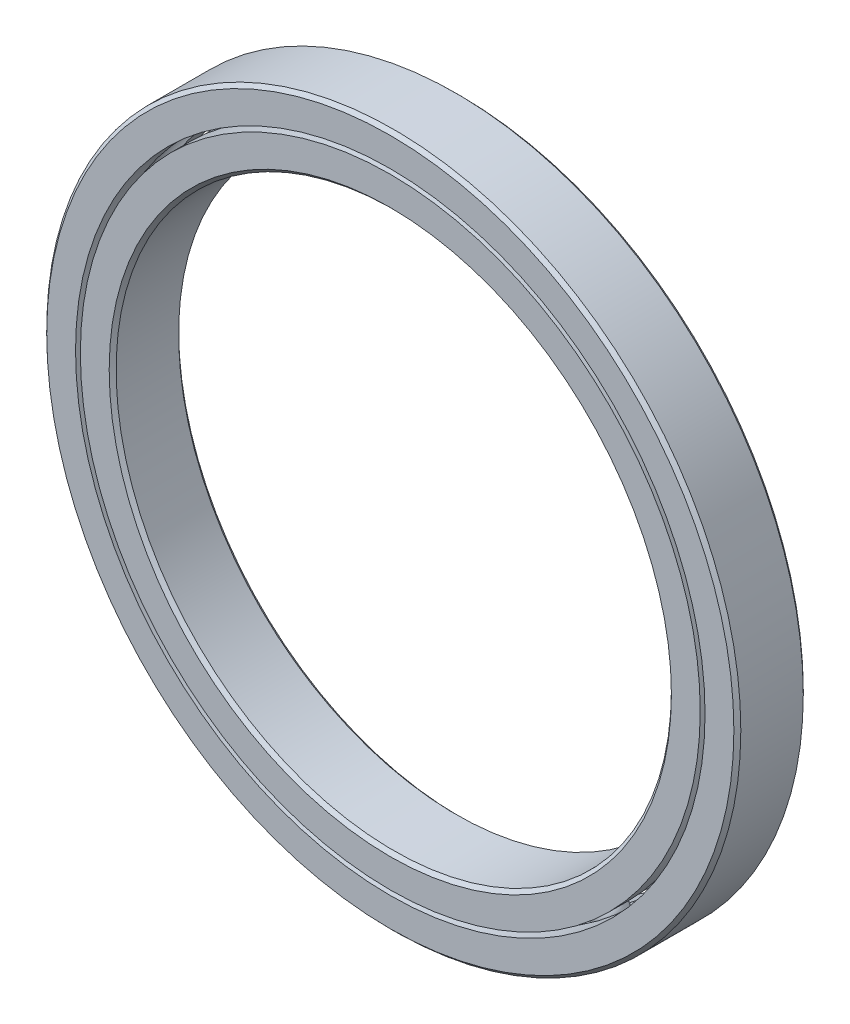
from build123d import *

# Parameters (mm, degrees)
CIRPATTERN1_COUNT = 10


with BuildPart() as part:
    # Sketch1 → Revolve1 (revolve)
    with BuildSketch(Plane(origin=(0, 0, 0), x_dir=(0, 0, -1), z_dir=(1, 0, 0)), mode=Mode.PRIVATE) as revolve1_sk:
        with BuildLine():
            Line((2.8575, 31.75), (-2.8575, 31.75))
            Line((-2.8575, 31.75), (-3.175, 31.4325))
            Line((-3.175, 31.4325), (-3.175, 28.794807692))
            Line((-3.175, 28.794807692), (-1.411111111, 28.794807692))
            ThreePointArc((-1.411111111, 28.794807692), (0, 30.003128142), (1.411111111, 28.794807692))
            Line((1.411111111, 28.794807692), (3.175, 28.794807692))
            Line((3.175, 28.794807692), (3.175, 31.4325))
            Line((3.175, 31.4325), (2.8575, 31.75))
        make_face()
    revolve(revolve1_sk.sketch.rotate(Axis((0, 0, 3.175), (0, 0, -1)), 90), axis=Axis((0, 0, 3.175), (0, 0, -1)))


with BuildPart() as body_2:
    # Sketch3 → Revolve3 (revolve)
    with BuildSketch(Plane(origin=(0, 0, 0), x_dir=(0, 0, -1), z_dir=(1, 0, 0)), mode=Mode.PRIVATE) as revolve3_sk:
        with BuildLine():
            Line((-3.175, 28.355192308), (-1.411111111, 28.355192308))
            ThreePointArc((-1.411111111, 28.355192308), (0, 27.146871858), (1.411111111, 28.355192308))
            Line((1.411111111, 28.355192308), (3.175, 28.355192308))
            Line((3.175, 28.355192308), (3.175, 25.7175))
            Line((3.175, 25.7175), (2.8575, 25.4))
            Line((2.8575, 25.4), (-2.8575, 25.4))
            Line((-2.8575, 25.4), (-3.175, 25.7175))
            Line((-3.175, 25.7175), (-3.175, 28.355192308))
        make_face()
    revolve(revolve3_sk.sketch.rotate(Axis((0, 0, 3.175), (0, 0, -1)), 90), axis=Axis((0, 0, 3.175), (0, 0, -1)))


with BuildPart() as body_3:
    # Sketch4 → Revolve4 (revolve)
    with BuildSketch(Plane(origin=(0, 0, 0), x_dir=(0, 0, -1), z_dir=(1, 0, 0))):
        with BuildLine():
            Line((-1.428128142, 28.575), (1.428128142, 28.575))
            ThreePointArc((1.428128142, 28.575), (0, 30.003128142), (-1.428128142, 28.575))
        make_face()
    revolve(axis=Axis((0, 28.575, 1.428128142), (0, 0, -1)))


with BuildPart() as cirpattern1_1:
    # CirPattern1: pattern copy
    add(body_3.part.rotate(Axis((0, 0, 0), (0, 0, 1)), 1 * 360 / CIRPATTERN1_COUNT))


with BuildPart() as cirpattern1_2:
    # CirPattern1: pattern copy
    add(body_3.part.rotate(Axis((0, 0, 0), (0, 0, 1)), 2 * 360 / CIRPATTERN1_COUNT))


with BuildPart() as cirpattern1_3:
    # CirPattern1: pattern copy
    add(body_3.part.rotate(Axis((0, 0, 0), (0, 0, 1)), 3 * 360 / CIRPATTERN1_COUNT))


with BuildPart() as cirpattern1_4:
    # CirPattern1: pattern copy
    add(body_3.part.rotate(Axis((0, 0, 0), (0, 0, 1)), 4 * 360 / CIRPATTERN1_COUNT))


with BuildPart() as cirpattern1_5:
    # CirPattern1: pattern copy
    add(body_3.part.rotate(Axis((0, 0, 0), (0, 0, 1)), 5 * 360 / CIRPATTERN1_COUNT))


with BuildPart() as cirpattern1_6:
    # CirPattern1: pattern copy
    add(body_3.part.rotate(Axis((0, 0, 0), (0, 0, 1)), 6 * 360 / CIRPATTERN1_COUNT))


with BuildPart() as cirpattern1_7:
    # CirPattern1: pattern copy
    add(body_3.part.rotate(Axis((0, 0, 0), (0, 0, 1)), 7 * 360 / CIRPATTERN1_COUNT))


with BuildPart() as cirpattern1_8:
    # CirPattern1: pattern copy
    add(body_3.part.rotate(Axis((0, 0, 0), (0, 0, 1)), 8 * 360 / CIRPATTERN1_COUNT))


with BuildPart() as cirpattern1_9:
    # CirPattern1: pattern copy
    add(body_3.part.rotate(Axis((0, 0, 0), (0, 0, 1)), 9 * 360 / CIRPATTERN1_COUNT))


solid = Compound([part.part, body_2.part, body_3.part, cirpattern1_1.part, cirpattern1_2.part, cirpattern1_3.part, cirpattern1_4.part, cirpattern1_5.part, cirpattern1_6.part, cirpattern1_7.part, cirpattern1_8.part, cirpattern1_9.part])
